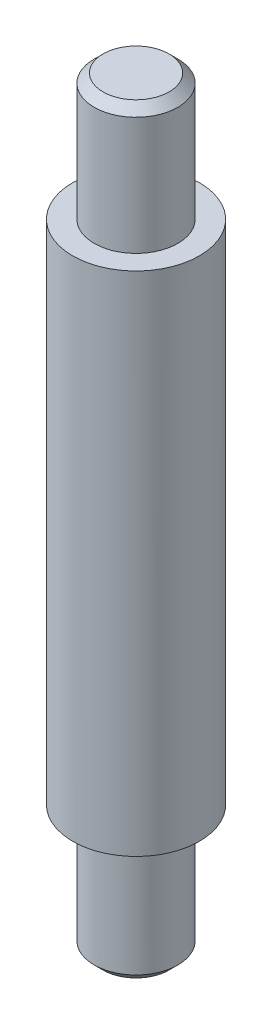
from build123d import *

# Parameters (mm, degrees)
SKETCH1_R      = 2.5
EXTRUDE1_DEPTH = 30
SKETCH2_R      = 4.993852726
SKETCH2_R_2    = 1.65
EXTRUDE2_DEPTH = 5
EXTRUDE3_START = -5
SKETCH3_R      = 5.081272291
SKETCH3_R_2    = 1.65
EXTRUDE3_DEPTH = 5
CHAMFER1_SIZE  = 0.35


with BuildPart() as part:
    # Sketch1 → Extrude1 (new body)
    with BuildSketch(Plane(origin=(0, 0, 0), x_dir=(1, 0, 0), z_dir=(0, 1, 0))):
        with Locations(Location((0, 0, 0), (0, 0, 270))):
            Circle(SKETCH1_R)
    extrude(amount=EXTRUDE1_DEPTH)

    # Sketch2 → Extrude2 (cut)
    with BuildSketch(Plane(origin=(0, 30, 0), x_dir=(1, 0, 0), z_dir=(0, 1, 0))):
        Circle(SKETCH2_R)
        with Locations(Location((0, 0, 0), (0, 0, 270))):
            Circle(SKETCH2_R_2, mode=Mode.SUBTRACT)
    extrude(amount=-EXTRUDE2_DEPTH, mode=Mode.SUBTRACT)

    # Sketch3 → Extrude3 (cut)
    with BuildSketch(Plane.XZ.offset(EXTRUDE3_START)):
        Circle(SKETCH3_R)
        with Locations(Location((0, 0, 0), (0, 0, 90))):
            Circle(SKETCH3_R_2, mode=Mode.SUBTRACT)
    extrude(amount=EXTRUDE3_DEPTH, mode=Mode.SUBTRACT)

    # Chamfer1
    chamfer1_edges = [part.edges().sort_by_distance(p)[0] for p in [
        (0, 0, -1.65),
        (0, 30, -1.65),
    ]]
    chamfer(chamfer1_edges, length=CHAMFER1_SIZE)


solid = part.part
